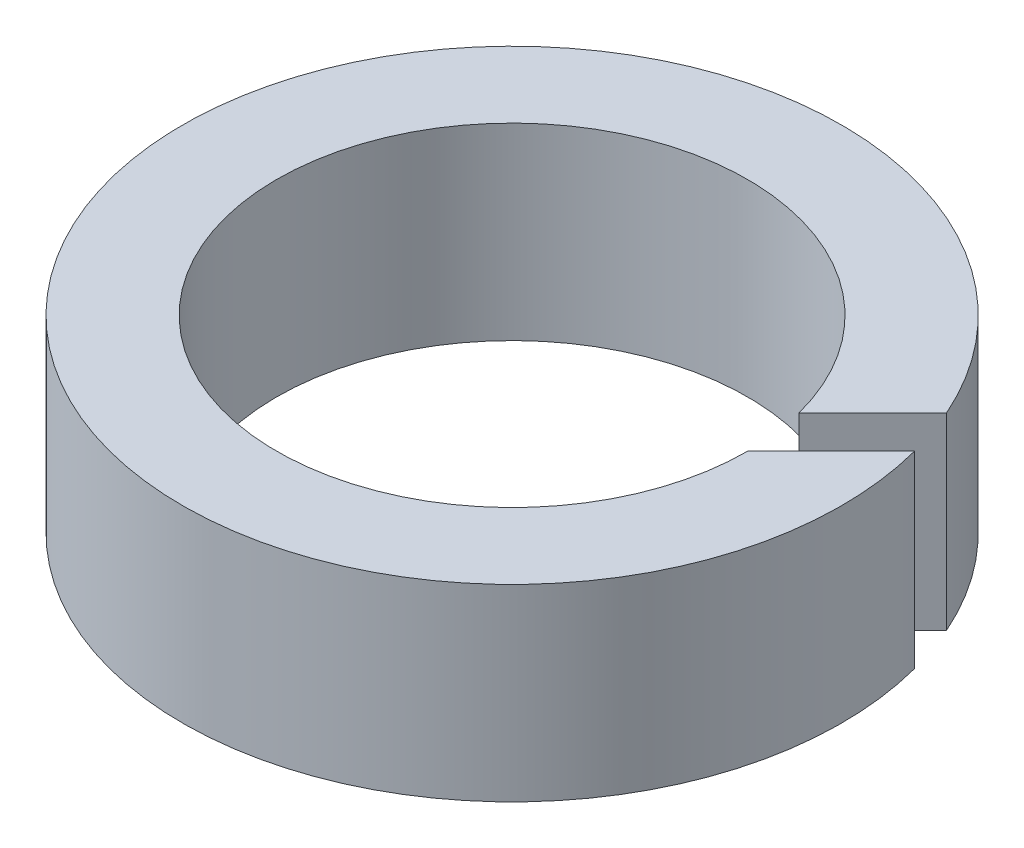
from build123d import *

# Parameters (mm, degrees)
BOSS_EXTRUDE1_DEPTH = 4


with BuildPart() as part:
    # Sketch1 (on Top Plane) → Boss-Extrude1 (new body)
    with BuildSketch(Plane(origin=(0, 0, 0), x_dir=(1, 0, 0), z_dir=(0, 1, 0))):
        with BuildLine():
            Line((5, 0), (6.772001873, 1.772001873))
            ThreePointArc((6.772001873, 1.772001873), (-6.610091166, -2.303626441), (6.406518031, 2.820731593))
            Line((6.406518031, 2.820731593), (4.840110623, 1.254324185))
            ThreePointArc((4.840110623, 1.254324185), (-4.959866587, -0.632236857), (5, 0))
        make_face()
    extrude(amount=BOSS_EXTRUDE1_DEPTH)


solid = part.part
